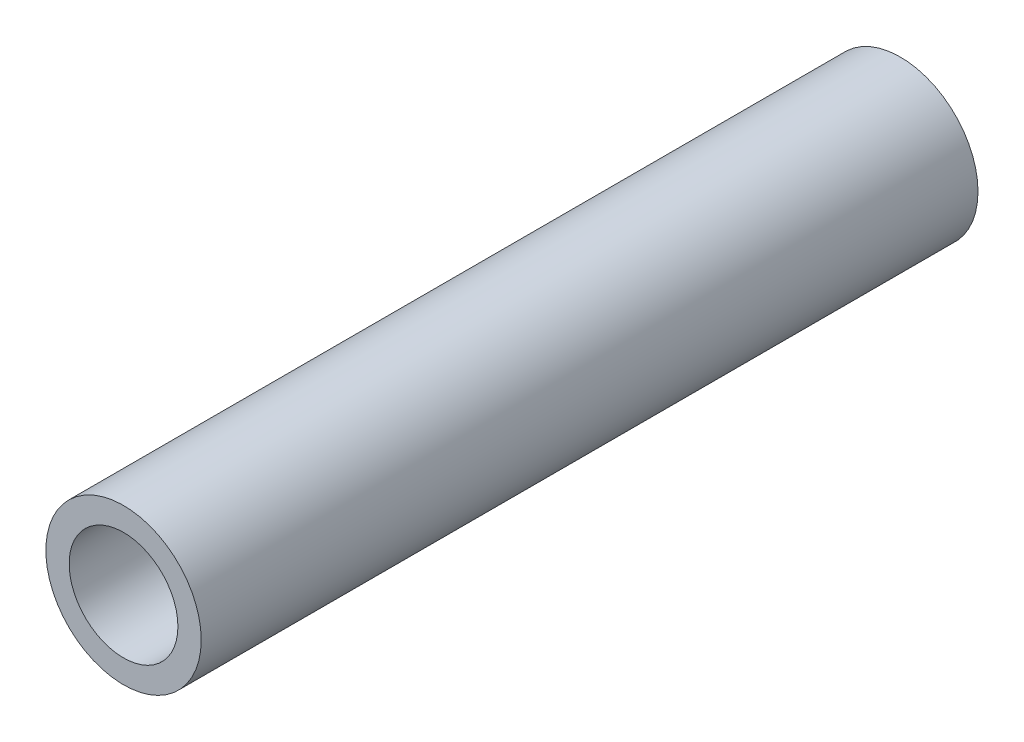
from build123d import *

# Parameters (mm, degrees)
ROHRSKIZZE_R             = 5
ROHRSKIZZE_R_2           = 3.5
LINEARE_AUSTRAGUNG_DEPTH = 50


with BuildPart() as part:
    # RohrSkizze → Lineare Austragung (new body)
    with BuildSketch(Plane.XY):
        Circle(ROHRSKIZZE_R)
        Circle(ROHRSKIZZE_R_2, mode=Mode.SUBTRACT)
    extrude(amount=LINEARE_AUSTRAGUNG_DEPTH)


solid = part.part
